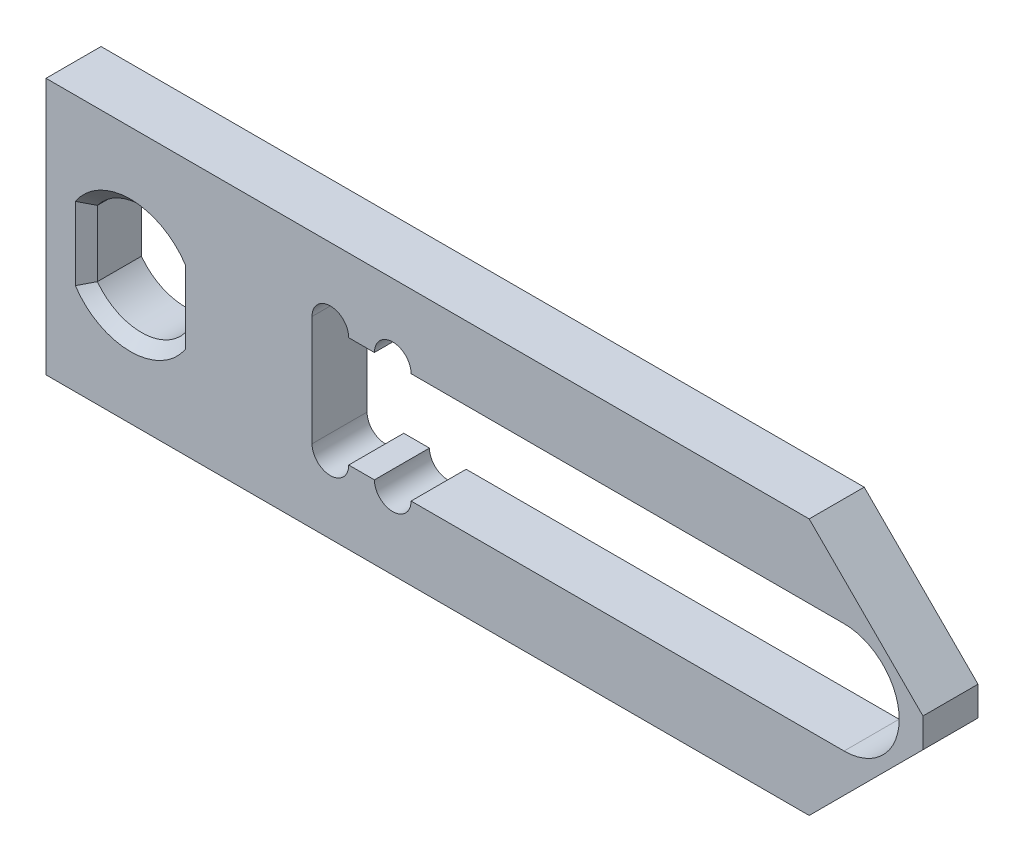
ISO-10303-21;
HEADER;
FILE_DESCRIPTION(('STEP AP214'),'2;1');
FILE_NAME('part.step','',(''),(''),'','','');
FILE_SCHEMA(('AUTOMOTIVE_DESIGN { 1 0 10303 214 1 1 1 1 }'));
ENDSEC;
DATA;
#1=APPLICATION_CONTEXT('core data for automotive mechanical design processes');
#2=APPLICATION_PROTOCOL_DEFINITION('international standard','automotive_design',2000,#1);
#3=PRODUCT_CONTEXT('',#1,'mechanical');
#4=PRODUCT('Part','Part','',(#3));
#5=PRODUCT_RELATED_PRODUCT_CATEGORY('part','',(#4));
#6=PRODUCT_DEFINITION_FORMATION('','',#4);
#7=PRODUCT_DEFINITION_CONTEXT('part definition',#1,'design');
#8=PRODUCT_DEFINITION('design','',#6,#7);
#9=PRODUCT_DEFINITION_SHAPE('','',#8);
#10=(LENGTH_UNIT() NAMED_UNIT(*) SI_UNIT(.MILLI.,.METRE.));
#11=(NAMED_UNIT(*) PLANE_ANGLE_UNIT() SI_UNIT($,.RADIAN.));
#12=(NAMED_UNIT(*) SI_UNIT($,.STERADIAN.) SOLID_ANGLE_UNIT());
#13=UNCERTAINTY_MEASURE_WITH_UNIT(LENGTH_MEASURE(1.E-05),#10,'distance_accuracy_value','');
#14=(GEOMETRIC_REPRESENTATION_CONTEXT(3) GLOBAL_UNCERTAINTY_ASSIGNED_CONTEXT((#13)) GLOBAL_UNIT_ASSIGNED_CONTEXT((#10,
#11,#12)) REPRESENTATION_CONTEXT('',''));
#15=CARTESIAN_POINT('',(0.,0.,0.));
#16=DIRECTION('',(0.,0.,1.));
#17=DIRECTION('',(1.,0.,0.));
#18=AXIS2_PLACEMENT_3D('',#15,#16,#17);
#19=CARTESIAN_POINT('',(-12.000000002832,8.99999999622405,7.5));
#20=DIRECTION('',(-1.,0.,0.));
#21=DIRECTION('',(0.,-1.,0.));
#22=AXIS2_PLACEMENT_3D('',#19,#20,#21);
#23=PLANE('',#22);
#24=DIRECTION('',(0.,0.,-1.));
#25=VECTOR('',#24,1.);
#26=CARTESIAN_POINT('',(-12.000000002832,8.99999999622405,7.5));
#27=LINE('',#26,#25);
#28=CARTESIAN_POINT('',(-12.000000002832,8.99999999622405,4.5));
#29=VERTEX_POINT('',#28);
#30=CARTESIAN_POINT('',(-12.000000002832,8.99999999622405,-7.5));
#31=VERTEX_POINT('',#30);
#32=EDGE_CURVE('E303',#29,#31,#27,.T.);
#33=ORIENTED_EDGE('',*,*,#32,.F.);
#34=DIRECTION('',(0.,-1.,0.));
#35=VECTOR('',#34,1.);
#36=CARTESIAN_POINT('',(-12.000000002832,-8.99999999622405,4.5));
#37=LINE('',#36,#35);
#38=CARTESIAN_POINT('',(-12.000000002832,-8.99999999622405,4.5));
#39=VERTEX_POINT('',#38);
#40=EDGE_CURVE('E11',#29,#39,#37,.T.);
#41=ORIENTED_EDGE('',*,*,#40,.T.);
#42=DIRECTION('',(0.,0.,-1.));
#43=VECTOR('',#42,1.);
#44=CARTESIAN_POINT('',(-12.000000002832,-8.99999999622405,7.5));
#45=LINE('',#44,#43);
#46=CARTESIAN_POINT('',(-12.000000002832,-8.99999999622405,-7.5));
#47=VERTEX_POINT('',#46);
#48=EDGE_CURVE('E306',#39,#47,#45,.T.);
#49=ORIENTED_EDGE('',*,*,#48,.T.);
#50=DIRECTION('',(0.,1.,0.));
#51=VECTOR('',#50,1.);
#52=CARTESIAN_POINT('',(-12.000000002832,8.99999999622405,-7.5));
#53=LINE('',#52,#51);
#54=EDGE_CURVE('E244',#47,#31,#53,.T.);
#55=ORIENTED_EDGE('',*,*,#54,.T.);
#56=EDGE_LOOP('',(#33,#41,#49,#55));
#57=FACE_BOUND('',#56,.T.);
#58=ADVANCED_FACE('F17',(#57),#23,.F.);
#59=CARTESIAN_POINT('',(0.,0.,7.5));
#60=DIRECTION('',(0.,0.,-1.));
#61=DIRECTION('',(-1.,0.,0.));
#62=AXIS2_PLACEMENT_3D('',#59,#60,#61);
#63=CYLINDRICAL_SURFACE('',#62,15.);
#64=DIRECTION('',(0.,0.,-1.));
#65=VECTOR('',#64,1.);
#66=CARTESIAN_POINT('',(12.000000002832,8.99999999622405,7.5));
#67=LINE('',#66,#65);
#68=CARTESIAN_POINT('',(12.000000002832,8.99999999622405,4.5));
#69=VERTEX_POINT('',#68);
#70=CARTESIAN_POINT('',(12.000000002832,8.99999999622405,-7.5));
#71=VERTEX_POINT('',#70);
#72=EDGE_CURVE('E301',#69,#71,#67,.T.);
#73=ORIENTED_EDGE('',*,*,#72,.F.);
#74=CARTESIAN_POINT('',(0.,0.,4.5));
#75=DIRECTION('',(0.,0.,1.));
#76=DIRECTION('',(1.,0.,0.));
#77=AXIS2_PLACEMENT_3D('',#74,#75,#76);
#78=CIRCLE('',#77,15.);
#79=EDGE_CURVE('E25',#69,#29,#78,.T.);
#80=ORIENTED_EDGE('',*,*,#79,.T.);
#81=ORIENTED_EDGE('',*,*,#32,.T.);
#82=CARTESIAN_POINT('',(0.,0.,-7.5));
#83=DIRECTION('',(0.,0.,-1.));
#84=DIRECTION('',(1.,0.,0.));
#85=AXIS2_PLACEMENT_3D('',#82,#83,#84);
#86=CIRCLE('',#85,15.);
#87=EDGE_CURVE('E256',#31,#71,#86,.T.);
#88=ORIENTED_EDGE('',*,*,#87,.T.);
#89=EDGE_LOOP('',(#73,#80,#81,#88));
#90=FACE_BOUND('',#89,.T.);
#91=ADVANCED_FACE('F411',(#90),#63,.F.);
#92=CARTESIAN_POINT('',(12.000000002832,8.99999999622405,7.5));
#93=DIRECTION('',(1.,0.,0.));
#94=DIRECTION('',(0.,1.,0.));
#95=AXIS2_PLACEMENT_3D('',#92,#93,#94);
#96=PLANE('',#95);
#97=DIRECTION('',(0.,0.,-1.));
#98=VECTOR('',#97,1.);
#99=CARTESIAN_POINT('',(12.000000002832,-8.99999999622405,7.5));
#100=LINE('',#99,#98);
#101=CARTESIAN_POINT('',(12.000000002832,-8.99999999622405,4.5));
#102=VERTEX_POINT('',#101);
#103=CARTESIAN_POINT('',(12.000000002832,-8.99999999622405,-7.5));
#104=VERTEX_POINT('',#103);
#105=EDGE_CURVE('E304',#102,#104,#100,.T.);
#106=ORIENTED_EDGE('',*,*,#105,.F.);
#107=DIRECTION('',(0.,1.,0.));
#108=VECTOR('',#107,1.);
#109=CARTESIAN_POINT('',(12.000000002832,8.99999999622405,4.5));
#110=LINE('',#109,#108);
#111=EDGE_CURVE('E39',#102,#69,#110,.T.);
#112=ORIENTED_EDGE('',*,*,#111,.T.);
#113=ORIENTED_EDGE('',*,*,#72,.T.);
#114=DIRECTION('',(0.,-1.,0.));
#115=VECTOR('',#114,1.);
#116=CARTESIAN_POINT('',(12.000000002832,8.99999999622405,-7.5));
#117=LINE('',#116,#115);
#118=EDGE_CURVE('E252',#71,#104,#117,.T.);
#119=ORIENTED_EDGE('',*,*,#118,.T.);
#120=EDGE_LOOP('',(#106,#112,#113,#119));
#121=FACE_BOUND('',#120,.T.);
#122=ADVANCED_FACE('F357',(#121),#96,.F.);
#123=CARTESIAN_POINT('',(71.5,-15.025,7.5));
#124=DIRECTION('',(0.,0.,-1.));
#125=DIRECTION('',(-1.,0.,0.));
#126=AXIS2_PLACEMENT_3D('',#123,#124,#125);
#127=CYLINDRICAL_SURFACE('',#126,5.);
#128=CARTESIAN_POINT('',(71.5,-15.025,-7.5));
#129=DIRECTION('',(0.,0.,1.));
#130=DIRECTION('',(-1.,0.,0.));
#131=AXIS2_PLACEMENT_3D('',#128,#129,#130);
#132=CIRCLE('',#131,5.);
#133=CARTESIAN_POINT('',(66.5,-15.025,-7.5));
#134=VERTEX_POINT('',#133);
#135=CARTESIAN_POINT('',(76.5,-15.025,-7.5));
#136=VERTEX_POINT('',#135);
#137=EDGE_CURVE('E240',#134,#136,#132,.T.);
#138=ORIENTED_EDGE('',*,*,#137,.F.);
#139=DIRECTION('',(0.,0.,-1.));
#140=VECTOR('',#139,1.);
#141=CARTESIAN_POINT('',(66.5,-15.025,7.5));
#142=LINE('',#141,#140);
#143=CARTESIAN_POINT('',(66.5,-15.025,7.5));
#144=VERTEX_POINT('',#143);
#145=EDGE_CURVE('E310',#144,#134,#142,.T.);
#146=ORIENTED_EDGE('',*,*,#145,.F.);
#147=CARTESIAN_POINT('',(71.5,-15.025,7.5));
#148=DIRECTION('',(0.,0.,1.));
#149=DIRECTION('',(-1.,0.,0.));
#150=AXIS2_PLACEMENT_3D('',#147,#148,#149);
#151=CIRCLE('',#150,5.);
#152=CARTESIAN_POINT('',(76.5,-15.025,7.5));
#153=VERTEX_POINT('',#152);
#154=EDGE_CURVE('E298',#144,#153,#151,.T.);
#155=ORIENTED_EDGE('',*,*,#154,.T.);
#156=DIRECTION('',(0.,0.,-1.));
#157=VECTOR('',#156,1.);
#158=CARTESIAN_POINT('',(76.5,-15.025,7.5));
#159=LINE('',#158,#157);
#160=EDGE_CURVE('E186',#153,#136,#159,.T.);
#161=ORIENTED_EDGE('',*,*,#160,.T.);
#162=EDGE_LOOP('',(#138,#146,#155,#161));
#163=FACE_BOUND('',#162,.T.);
#164=ADVANCED_FACE('F416',(#163),#127,.F.);
#165=CARTESIAN_POINT('',(59.5,-15.025,7.5));
#166=DIRECTION('',(0.,1.,0.));
#167=DIRECTION('',(-1.,0.,0.));
#168=AXIS2_PLACEMENT_3D('',#165,#166,#167);
#169=PLANE('',#168);
#170=DIRECTION('',(1.,0.,0.));
#171=VECTOR('',#170,1.);
#172=CARTESIAN_POINT('',(59.5,-15.025,-7.5));
#173=LINE('',#172,#171);
#174=CARTESIAN_POINT('',(59.5,-15.025,-7.5));
#175=VERTEX_POINT('',#174);
#176=EDGE_CURVE('E204',#175,#134,#173,.T.);
#177=ORIENTED_EDGE('',*,*,#176,.F.);
#178=DIRECTION('',(0.,0.,-1.));
#179=VECTOR('',#178,1.);
#180=CARTESIAN_POINT('',(59.5,-15.025,7.5));
#181=LINE('',#180,#179);
#182=CARTESIAN_POINT('',(59.5,-15.025,7.5));
#183=VERTEX_POINT('',#182);
#184=EDGE_CURVE('E326',#183,#175,#181,.T.);
#185=ORIENTED_EDGE('',*,*,#184,.F.);
#186=DIRECTION('',(1.,0.,0.));
#187=VECTOR('',#186,1.);
#188=CARTESIAN_POINT('',(59.5,-15.025,7.5));
#189=LINE('',#188,#187);
#190=EDGE_CURVE('E270',#183,#144,#189,.T.);
#191=ORIENTED_EDGE('',*,*,#190,.T.);
#192=ORIENTED_EDGE('',*,*,#145,.T.);
#193=EDGE_LOOP('',(#177,#185,#191,#192));
#194=FACE_BOUND('',#193,.T.);
#195=ADVANCED_FACE('F424',(#194),#169,.T.);
#196=CARTESIAN_POINT('',(54.5,-15.025,7.5));
#197=DIRECTION('',(0.,0.,-1.));
#198=DIRECTION('',(-1.,0.,0.));
#199=AXIS2_PLACEMENT_3D('',#196,#197,#198);
#200=CYLINDRICAL_SURFACE('',#199,5.);
#201=CARTESIAN_POINT('',(54.5,-15.025,-7.5));
#202=DIRECTION('',(0.,0.,1.));
#203=DIRECTION('',(-1.,0.,0.));
#204=AXIS2_PLACEMENT_3D('',#201,#202,#203);
#205=CIRCLE('',#204,5.);
#206=CARTESIAN_POINT('',(49.5,-15.025,-7.5));
#207=VERTEX_POINT('',#206);
#208=EDGE_CURVE('E208',#207,#175,#205,.T.);
#209=ORIENTED_EDGE('',*,*,#208,.F.);
#210=DIRECTION('',(0.,0.,-1.));
#211=VECTOR('',#210,1.);
#212=CARTESIAN_POINT('',(49.5,-15.025,7.5));
#213=LINE('',#212,#211);
#214=CARTESIAN_POINT('',(49.5,-15.025,7.5));
#215=VERTEX_POINT('',#214);
#216=EDGE_CURVE('E324',#215,#207,#213,.T.);
#217=ORIENTED_EDGE('',*,*,#216,.F.);
#218=CARTESIAN_POINT('',(54.5,-15.025,7.5));
#219=DIRECTION('',(0.,0.,1.));
#220=DIRECTION('',(-1.,0.,0.));
#221=AXIS2_PLACEMENT_3D('',#218,#219,#220);
#222=CIRCLE('',#221,5.);
#223=EDGE_CURVE('E274',#215,#183,#222,.T.);
#224=ORIENTED_EDGE('',*,*,#223,.T.);
#225=ORIENTED_EDGE('',*,*,#184,.T.);
#226=EDGE_LOOP('',(#209,#217,#224,#225));
#227=FACE_BOUND('',#226,.T.);
#228=ADVANCED_FACE('F454',(#227),#200,.F.);
#229=CARTESIAN_POINT('',(49.5,15.025,7.5));
#230=DIRECTION('',(1.,0.,0.));
#231=DIRECTION('',(0.,0.,-1.));
#232=AXIS2_PLACEMENT_3D('',#229,#230,#231);
#233=PLANE('',#232);
#234=DIRECTION('',(0.,-1.,0.));
#235=VECTOR('',#234,1.);
#236=CARTESIAN_POINT('',(49.5,15.025,-7.5));
#237=LINE('',#236,#235);
#238=CARTESIAN_POINT('',(49.5,15.025,-7.5));
#239=VERTEX_POINT('',#238);
#240=EDGE_CURVE('E212',#239,#207,#237,.T.);
#241=ORIENTED_EDGE('',*,*,#240,.F.);
#242=DIRECTION('',(0.,0.,-1.));
#243=VECTOR('',#242,1.);
#244=CARTESIAN_POINT('',(49.5,15.025,7.5));
#245=LINE('',#244,#243);
#246=CARTESIAN_POINT('',(49.5,15.025,7.5));
#247=VERTEX_POINT('',#246);
#248=EDGE_CURVE('E322',#247,#239,#245,.T.);
#249=ORIENTED_EDGE('',*,*,#248,.F.);
#250=DIRECTION('',(0.,-1.,0.));
#251=VECTOR('',#250,1.);
#252=CARTESIAN_POINT('',(49.5,15.025,7.5));
#253=LINE('',#252,#251);
#254=EDGE_CURVE('E277',#247,#215,#253,.T.);
#255=ORIENTED_EDGE('',*,*,#254,.T.);
#256=ORIENTED_EDGE('',*,*,#216,.T.);
#257=EDGE_LOOP('',(#241,#249,#255,#256));
#258=FACE_BOUND('',#257,.T.);
#259=ADVANCED_FACE('F450',(#258),#233,.T.);
#260=CARTESIAN_POINT('',(54.5,15.025,7.5));
#261=DIRECTION('',(0.,0.,-1.));
#262=DIRECTION('',(-1.,0.,0.));
#263=AXIS2_PLACEMENT_3D('',#260,#261,#262);
#264=CYLINDRICAL_SURFACE('',#263,5.);
#265=CARTESIAN_POINT('',(54.5,15.025,-7.5));
#266=DIRECTION('',(0.,0.,1.));
#267=DIRECTION('',(1.,0.,0.));
#268=AXIS2_PLACEMENT_3D('',#265,#266,#267);
#269=CIRCLE('',#268,5.);
#270=CARTESIAN_POINT('',(59.5,15.025,-7.5));
#271=VERTEX_POINT('',#270);
#272=EDGE_CURVE('E216',#271,#239,#269,.T.);
#273=ORIENTED_EDGE('',*,*,#272,.F.);
#274=DIRECTION('',(0.,0.,-1.));
#275=VECTOR('',#274,1.);
#276=CARTESIAN_POINT('',(59.5,15.025,7.5));
#277=LINE('',#276,#275);
#278=CARTESIAN_POINT('',(59.5,15.025,7.5));
#279=VERTEX_POINT('',#278);
#280=EDGE_CURVE('E320',#279,#271,#277,.T.);
#281=ORIENTED_EDGE('',*,*,#280,.F.);
#282=CARTESIAN_POINT('',(54.5,15.025,7.5));
#283=DIRECTION('',(0.,0.,1.));
#284=DIRECTION('',(1.,0.,0.));
#285=AXIS2_PLACEMENT_3D('',#282,#283,#284);
#286=CIRCLE('',#285,5.);
#287=EDGE_CURVE('E280',#279,#247,#286,.T.);
#288=ORIENTED_EDGE('',*,*,#287,.T.);
#289=ORIENTED_EDGE('',*,*,#248,.T.);
#290=EDGE_LOOP('',(#273,#281,#288,#289));
#291=FACE_BOUND('',#290,.T.);
#292=ADVANCED_FACE('F446',(#291),#264,.F.);
#293=CARTESIAN_POINT('',(66.5,15.025,7.5));
#294=DIRECTION('',(0.,-1.,0.));
#295=DIRECTION('',(1.,0.,0.));
#296=AXIS2_PLACEMENT_3D('',#293,#294,#295);
#297=PLANE('',#296);
#298=DIRECTION('',(-1.,0.,0.));
#299=VECTOR('',#298,1.);
#300=CARTESIAN_POINT('',(66.5,15.025,-7.5));
#301=LINE('',#300,#299);
#302=CARTESIAN_POINT('',(66.5,15.025,-7.5));
#303=VERTEX_POINT('',#302);
#304=EDGE_CURVE('E220',#303,#271,#301,.T.);
#305=ORIENTED_EDGE('',*,*,#304,.F.);
#306=DIRECTION('',(0.,0.,-1.));
#307=VECTOR('',#306,1.);
#308=CARTESIAN_POINT('',(66.5,15.025,7.5));
#309=LINE('',#308,#307);
#310=CARTESIAN_POINT('',(66.5,15.025,7.5));
#311=VERTEX_POINT('',#310);
#312=EDGE_CURVE('E318',#311,#303,#309,.T.);
#313=ORIENTED_EDGE('',*,*,#312,.F.);
#314=DIRECTION('',(-1.,0.,0.));
#315=VECTOR('',#314,1.);
#316=CARTESIAN_POINT('',(66.5,15.025,7.5));
#317=LINE('',#316,#315);
#318=EDGE_CURVE('E283',#311,#279,#317,.T.);
#319=ORIENTED_EDGE('',*,*,#318,.T.);
#320=ORIENTED_EDGE('',*,*,#280,.T.);
#321=EDGE_LOOP('',(#305,#313,#319,#320));
#322=FACE_BOUND('',#321,.T.);
#323=ADVANCED_FACE('F442',(#322),#297,.T.);
#324=CARTESIAN_POINT('',(71.5,15.025,7.5));
#325=DIRECTION('',(0.,0.,-1.));
#326=DIRECTION('',(-1.,0.,0.));
#327=AXIS2_PLACEMENT_3D('',#324,#325,#326);
#328=CYLINDRICAL_SURFACE('',#327,5.);
#329=CARTESIAN_POINT('',(71.5,15.025,-7.5));
#330=DIRECTION('',(0.,0.,1.));
#331=DIRECTION('',(1.,0.,0.));
#332=AXIS2_PLACEMENT_3D('',#329,#330,#331);
#333=CIRCLE('',#332,5.);
#334=CARTESIAN_POINT('',(76.5,15.025,-7.5));
#335=VERTEX_POINT('',#334);
#336=EDGE_CURVE('E224',#335,#303,#333,.T.);
#337=ORIENTED_EDGE('',*,*,#336,.F.);
#338=DIRECTION('',(0.,0.,-1.));
#339=VECTOR('',#338,1.);
#340=CARTESIAN_POINT('',(76.5,15.025,7.5));
#341=LINE('',#340,#339);
#342=CARTESIAN_POINT('',(76.5,15.025,7.5));
#343=VERTEX_POINT('',#342);
#344=EDGE_CURVE('E316',#343,#335,#341,.T.);
#345=ORIENTED_EDGE('',*,*,#344,.F.);
#346=CARTESIAN_POINT('',(71.5,15.025,7.5));
#347=DIRECTION('',(0.,0.,1.));
#348=DIRECTION('',(1.,0.,0.));
#349=AXIS2_PLACEMENT_3D('',#346,#347,#348);
#350=CIRCLE('',#349,5.);
#351=EDGE_CURVE('E286',#343,#311,#350,.T.);
#352=ORIENTED_EDGE('',*,*,#351,.T.);
#353=ORIENTED_EDGE('',*,*,#312,.T.);
#354=EDGE_LOOP('',(#337,#345,#352,#353));
#355=FACE_BOUND('',#354,.T.);
#356=ADVANCED_FACE('F438',(#355),#328,.F.);
#357=CARTESIAN_POINT('',(194.5,15.025,7.5));
#358=DIRECTION('',(0.,-1.,0.));
#359=DIRECTION('',(1.,0.,0.));
#360=AXIS2_PLACEMENT_3D('',#357,#358,#359);
#361=PLANE('',#360);
#362=DIRECTION('',(-1.,0.,0.));
#363=VECTOR('',#362,1.);
#364=CARTESIAN_POINT('',(194.5,15.025,-7.5));
#365=LINE('',#364,#363);
#366=CARTESIAN_POINT('',(194.5,15.025,-7.5));
#367=VERTEX_POINT('',#366);
#368=EDGE_CURVE('E228',#367,#335,#365,.T.);
#369=ORIENTED_EDGE('',*,*,#368,.F.);
#370=DIRECTION('',(0.,0.,-1.));
#371=VECTOR('',#370,1.);
#372=CARTESIAN_POINT('',(194.5,15.025,7.5));
#373=LINE('',#372,#371);
#374=CARTESIAN_POINT('',(194.5,15.025,7.5));
#375=VERTEX_POINT('',#374);
#376=EDGE_CURVE('E314',#375,#367,#373,.T.);
#377=ORIENTED_EDGE('',*,*,#376,.F.);
#378=DIRECTION('',(-1.,0.,0.));
#379=VECTOR('',#378,1.);
#380=CARTESIAN_POINT('',(194.5,15.025,7.5));
#381=LINE('',#380,#379);
#382=EDGE_CURVE('E289',#375,#343,#381,.T.);
#383=ORIENTED_EDGE('',*,*,#382,.T.);
#384=ORIENTED_EDGE('',*,*,#344,.T.);
#385=EDGE_LOOP('',(#369,#377,#383,#384));
#386=FACE_BOUND('',#385,.T.);
#387=ADVANCED_FACE('F434',(#386),#361,.T.);
#388=CARTESIAN_POINT('',(194.5,0.,7.5));
#389=DIRECTION('',(0.,0.,-1.));
#390=DIRECTION('',(-1.,0.,0.));
#391=AXIS2_PLACEMENT_3D('',#388,#389,#390);
#392=CYLINDRICAL_SURFACE('',#391,15.025);
#393=CARTESIAN_POINT('',(194.5,0.,-7.5));
#394=DIRECTION('',(0.,0.,1.));
#395=DIRECTION('',(-1.,0.,0.));
#396=AXIS2_PLACEMENT_3D('',#393,#394,#395);
#397=CIRCLE('',#396,15.025);
#398=CARTESIAN_POINT('',(194.5,-15.025,-7.5));
#399=VERTEX_POINT('',#398);
#400=EDGE_CURVE('E232',#399,#367,#397,.T.);
#401=ORIENTED_EDGE('',*,*,#400,.F.);
#402=DIRECTION('',(0.,0.,-1.));
#403=VECTOR('',#402,1.);
#404=CARTESIAN_POINT('',(194.5,-15.025,7.5));
#405=LINE('',#404,#403);
#406=CARTESIAN_POINT('',(194.5,-15.025,7.5));
#407=VERTEX_POINT('',#406);
#408=EDGE_CURVE('E312',#407,#399,#405,.T.);
#409=ORIENTED_EDGE('',*,*,#408,.F.);
#410=CARTESIAN_POINT('',(194.5,0.,7.5));
#411=DIRECTION('',(0.,0.,1.));
#412=DIRECTION('',(-1.,0.,0.));
#413=AXIS2_PLACEMENT_3D('',#410,#411,#412);
#414=CIRCLE('',#413,15.025);
#415=EDGE_CURVE('E292',#407,#375,#414,.T.);
#416=ORIENTED_EDGE('',*,*,#415,.T.);
#417=ORIENTED_EDGE('',*,*,#376,.T.);
#418=EDGE_LOOP('',(#401,#409,#416,#417));
#419=FACE_BOUND('',#418,.T.);
#420=ADVANCED_FACE('F431',(#419),#392,.F.);
#421=CARTESIAN_POINT('',(-23.,35.,7.5));
#422=DIRECTION('',(1.,0.,0.));
#423=DIRECTION('',(0.,0.,-1.));
#424=AXIS2_PLACEMENT_3D('',#421,#422,#423);
#425=PLANE('',#424);
#426=DIRECTION('',(0.,-1.,0.));
#427=VECTOR('',#426,1.);
#428=CARTESIAN_POINT('',(-23.,35.,-7.5));
#429=LINE('',#428,#427);
#430=CARTESIAN_POINT('',(-23.,35.,-7.5));
#431=VERTEX_POINT('',#430);
#432=CARTESIAN_POINT('',(-23.,-35.,-7.5));
#433=VERTEX_POINT('',#432);
#434=EDGE_CURVE('E171',#431,#433,#429,.T.);
#435=ORIENTED_EDGE('',*,*,#434,.T.);
#436=DIRECTION('',(0.,0.,-1.));
#437=VECTOR('',#436,1.);
#438=CARTESIAN_POINT('',(-23.,-35.,7.5));
#439=LINE('',#438,#437);
#440=CARTESIAN_POINT('',(-23.,-35.,7.5));
#441=VERTEX_POINT('',#440);
#442=EDGE_CURVE('E180',#441,#433,#439,.T.);
#443=ORIENTED_EDGE('',*,*,#442,.F.);
#444=DIRECTION('',(0.,-1.,0.));
#445=VECTOR('',#444,1.);
#446=CARTESIAN_POINT('',(-23.,35.,7.5));
#447=LINE('',#446,#445);
#448=CARTESIAN_POINT('',(-23.,35.,7.5));
#449=VERTEX_POINT('',#448);
#450=EDGE_CURVE('E260',#449,#441,#447,.T.);
#451=ORIENTED_EDGE('',*,*,#450,.F.);
#452=DIRECTION('',(0.,0.,-1.));
#453=VECTOR('',#452,1.);
#454=CARTESIAN_POINT('',(-23.,35.,7.5));
#455=LINE('',#454,#453);
#456=EDGE_CURVE('E191',#449,#431,#455,.T.);
#457=ORIENTED_EDGE('',*,*,#456,.T.);
#458=EDGE_LOOP('',(#435,#443,#451,#457));
#459=FACE_BOUND('',#458,.T.);
#460=ADVANCED_FACE('F19',(#459),#425,.F.);
#461=CARTESIAN_POINT('',(-23.,-35.,7.5));
#462=DIRECTION('',(0.,1.,0.));
#463=DIRECTION('',(0.,0.,1.));
#464=AXIS2_PLACEMENT_3D('',#461,#462,#463);
#465=PLANE('',#464);
#466=DIRECTION('',(1.,0.,0.));
#467=VECTOR('',#466,1.);
#468=CARTESIAN_POINT('',(-23.,-35.,-7.5));
#469=LINE('',#468,#467);
#470=CARTESIAN_POINT('',(184.991199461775,-35.,-7.5));
#471=VERTEX_POINT('',#470);
#472=EDGE_CURVE('E165',#433,#471,#469,.T.);
#473=ORIENTED_EDGE('',*,*,#472,.T.);
#474=DIRECTION('',(0.,0.,-1.));
#475=VECTOR('',#474,1.);
#476=CARTESIAN_POINT('',(184.991199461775,-35.,7.5));
#477=LINE('',#476,#475);
#478=CARTESIAN_POINT('',(184.991199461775,-35.,7.5));
#479=VERTEX_POINT('',#478);
#480=EDGE_CURVE('E187',#479,#471,#477,.T.);
#481=ORIENTED_EDGE('',*,*,#480,.F.);
#482=DIRECTION('',(1.,0.,0.));
#483=VECTOR('',#482,1.);
#484=CARTESIAN_POINT('',(-23.,-35.,7.5));
#485=LINE('',#484,#483);
#486=EDGE_CURVE('E182',#441,#479,#485,.T.);
#487=ORIENTED_EDGE('',*,*,#486,.F.);
#488=ORIENTED_EDGE('',*,*,#442,.T.);
#489=EDGE_LOOP('',(#473,#481,#487,#488));
#490=FACE_BOUND('',#489,.T.);
#491=ADVANCED_FACE('F181',(#490),#465,.F.);
#492=CARTESIAN_POINT('',(216.,-3.99119946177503,7.5));
#493=DIRECTION('',(-0.707106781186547,0.707106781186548,0.));
#494=DIRECTION('',(-0.707106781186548,-0.707106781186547,0.));
#495=AXIS2_PLACEMENT_3D('',#492,#493,#494);
#496=PLANE('',#495);
#497=DIRECTION('',(0.707106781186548,0.707106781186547,0.));
#498=VECTOR('',#497,1.);
#499=CARTESIAN_POINT('',(216.,-3.99119946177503,-7.5));
#500=LINE('',#499,#498);
#501=CARTESIAN_POINT('',(216.,-3.99119946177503,-7.5));
#502=VERTEX_POINT('',#501);
#503=EDGE_CURVE('E173',#471,#502,#500,.T.);
#504=ORIENTED_EDGE('',*,*,#503,.T.);
#505=DIRECTION('',(0.,0.,-1.));
#506=VECTOR('',#505,1.);
#507=CARTESIAN_POINT('',(216.,-3.99119946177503,7.5));
#508=LINE('',#507,#506);
#509=CARTESIAN_POINT('',(216.,-3.99119946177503,7.5));
#510=VERTEX_POINT('',#509);
#511=EDGE_CURVE('E336',#510,#502,#508,.T.);
#512=ORIENTED_EDGE('',*,*,#511,.F.);
#513=DIRECTION('',(0.707106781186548,0.707106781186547,0.));
#514=VECTOR('',#513,1.);
#515=CARTESIAN_POINT('',(216.,-3.99119946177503,7.5));
#516=LINE('',#515,#514);
#517=EDGE_CURVE('E262',#479,#510,#516,.T.);
#518=ORIENTED_EDGE('',*,*,#517,.F.);
#519=ORIENTED_EDGE('',*,*,#480,.T.);
#520=EDGE_LOOP('',(#504,#512,#518,#519));
#521=FACE_BOUND('',#520,.T.);
#522=ADVANCED_FACE('F471',(#521),#496,.F.);
#523=CARTESIAN_POINT('',(216.,-3.99119946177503,7.5));
#524=DIRECTION('',(-1.,0.,0.));
#525=DIRECTION('',(0.,-1.,0.));
#526=AXIS2_PLACEMENT_3D('',#523,#524,#525);
#527=PLANE('',#526);
#528=DIRECTION('',(0.,1.,0.));
#529=VECTOR('',#528,1.);
#530=CARTESIAN_POINT('',(216.,-3.99119946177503,-7.5));
#531=LINE('',#530,#529);
#532=CARTESIAN_POINT('',(216.000000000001,3.9911994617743,-7.5));
#533=VERTEX_POINT('',#532);
#534=EDGE_CURVE('E885',#502,#533,#531,.T.);
#535=ORIENTED_EDGE('',*,*,#534,.T.);
#536=DIRECTION('',(0.,0.,-1.));
#537=VECTOR('',#536,1.);
#538=CARTESIAN_POINT('',(216.000000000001,3.9911994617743,7.5));
#539=LINE('',#538,#537);
#540=CARTESIAN_POINT('',(216.000000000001,3.9911994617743,7.5));
#541=VERTEX_POINT('',#540);
#542=EDGE_CURVE('E333',#541,#533,#539,.T.);
#543=ORIENTED_EDGE('',*,*,#542,.F.);
#544=DIRECTION('',(0.,1.,0.));
#545=VECTOR('',#544,1.);
#546=CARTESIAN_POINT('',(216.,-3.99119946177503,7.5));
#547=LINE('',#546,#545);
#548=EDGE_CURVE('E264',#510,#541,#547,.T.);
#549=ORIENTED_EDGE('',*,*,#548,.F.);
#550=ORIENTED_EDGE('',*,*,#511,.T.);
#551=EDGE_LOOP('',(#535,#543,#549,#550));
#552=FACE_BOUND('',#551,.T.);
#553=ADVANCED_FACE('F467',(#552),#527,.F.);
#554=CARTESIAN_POINT('',(184.991199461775,35.0000000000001,7.5));
#555=DIRECTION('',(-0.707106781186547,-0.707106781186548,0.));
#556=DIRECTION('',(0.707106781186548,-0.707106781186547,0.));
#557=AXIS2_PLACEMENT_3D('',#554,#555,#556);
#558=PLANE('',#557);
#559=DIRECTION('',(-0.707106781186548,0.707106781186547,0.));
#560=VECTOR('',#559,1.);
#561=CARTESIAN_POINT('',(184.991199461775,35.0000000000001,-7.5));
#562=LINE('',#561,#560);
#563=CARTESIAN_POINT('',(184.991199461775,35.0000000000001,-7.5));
#564=VERTEX_POINT('',#563);
#565=EDGE_CURVE('E882',#533,#564,#562,.T.);
#566=ORIENTED_EDGE('',*,*,#565,.T.);
#567=DIRECTION('',(0.,0.,-1.));
#568=VECTOR('',#567,1.);
#569=CARTESIAN_POINT('',(184.991199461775,35.0000000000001,7.5));
#570=LINE('',#569,#568);
#571=CARTESIAN_POINT('',(184.991199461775,35.0000000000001,7.5));
#572=VERTEX_POINT('',#571);
#573=EDGE_CURVE('E330',#572,#564,#570,.T.);
#574=ORIENTED_EDGE('',*,*,#573,.F.);
#575=DIRECTION('',(-0.707106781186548,0.707106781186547,0.));
#576=VECTOR('',#575,1.);
#577=CARTESIAN_POINT('',(184.991199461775,35.0000000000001,7.5));
#578=LINE('',#577,#576);
#579=EDGE_CURVE('E266',#541,#572,#578,.T.);
#580=ORIENTED_EDGE('',*,*,#579,.F.);
#581=ORIENTED_EDGE('',*,*,#542,.T.);
#582=EDGE_LOOP('',(#566,#574,#580,#581));
#583=FACE_BOUND('',#582,.T.);
#584=ADVANCED_FACE('F429',(#583),#558,.F.);
#585=CARTESIAN_POINT('',(76.5,-15.025,7.5));
#586=DIRECTION('',(0.,1.,0.));
#587=DIRECTION('',(-1.,0.,0.));
#588=AXIS2_PLACEMENT_3D('',#585,#586,#587);
#589=PLANE('',#588);
#590=DIRECTION('',(1.,0.,0.));
#591=VECTOR('',#590,1.);
#592=CARTESIAN_POINT('',(76.5,-15.025,-7.5));
#593=LINE('',#592,#591);
#594=EDGE_CURVE('E236',#136,#399,#593,.T.);
#595=ORIENTED_EDGE('',*,*,#594,.F.);
#596=ORIENTED_EDGE('',*,*,#160,.F.);
#597=DIRECTION('',(1.,0.,0.));
#598=VECTOR('',#597,1.);
#599=CARTESIAN_POINT('',(76.5,-15.025,7.5));
#600=LINE('',#599,#598);
#601=EDGE_CURVE('E295',#153,#407,#600,.T.);
#602=ORIENTED_EDGE('',*,*,#601,.T.);
#603=ORIENTED_EDGE('',*,*,#408,.T.);
#604=EDGE_LOOP('',(#595,#596,#602,#603));
#605=FACE_BOUND('',#604,.T.);
#606=ADVANCED_FACE('F426',(#605),#589,.T.);
#607=CARTESIAN_POINT('',(184.991199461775,35.0000000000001,7.5));
#608=DIRECTION('',(0.,-1.,0.));
#609=DIRECTION('',(1.,0.,0.));
#610=AXIS2_PLACEMENT_3D('',#607,#608,#609);
#611=PLANE('',#610);
#612=DIRECTION('',(-1.,0.,0.));
#613=VECTOR('',#612,1.);
#614=CARTESIAN_POINT('',(184.991199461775,35.0000000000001,-7.5));
#615=LINE('',#614,#613);
#616=EDGE_CURVE('E202',#564,#431,#615,.T.);
#617=ORIENTED_EDGE('',*,*,#616,.T.);
#618=ORIENTED_EDGE('',*,*,#456,.F.);
#619=DIRECTION('',(-1.,0.,0.));
#620=VECTOR('',#619,1.);
#621=CARTESIAN_POINT('',(184.991199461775,35.0000000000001,7.5));
#622=LINE('',#621,#620);
#623=EDGE_CURVE('E268',#572,#449,#622,.T.);
#624=ORIENTED_EDGE('',*,*,#623,.F.);
#625=ORIENTED_EDGE('',*,*,#573,.T.);
#626=EDGE_LOOP('',(#617,#618,#624,#625));
#627=FACE_BOUND('',#626,.T.);
#628=ADVANCED_FACE('F419',(#627),#611,.F.);
#629=CARTESIAN_POINT('',(0.,0.,7.5));
#630=DIRECTION('',(0.,0.,-1.));
#631=DIRECTION('',(-1.,0.,0.));
#632=AXIS2_PLACEMENT_3D('',#629,#630,#631);
#633=CYLINDRICAL_SURFACE('',#632,15.);
#634=ORIENTED_EDGE('',*,*,#48,.F.);
#635=CARTESIAN_POINT('',(0.,0.,4.5));
#636=DIRECTION('',(0.,0.,1.));
#637=DIRECTION('',(1.,0.,0.));
#638=AXIS2_PLACEMENT_3D('',#635,#636,#637);
#639=CIRCLE('',#638,15.);
#640=EDGE_CURVE('E348',#39,#102,#639,.T.);
#641=ORIENTED_EDGE('',*,*,#640,.T.);
#642=ORIENTED_EDGE('',*,*,#105,.T.);
#643=CARTESIAN_POINT('',(0.,0.,-7.5));
#644=DIRECTION('',(0.,0.,-1.));
#645=DIRECTION('',(1.,0.,0.));
#646=AXIS2_PLACEMENT_3D('',#643,#644,#645);
#647=CIRCLE('',#646,15.);
#648=EDGE_CURVE('E248',#104,#47,#647,.T.);
#649=ORIENTED_EDGE('',*,*,#648,.T.);
#650=EDGE_LOOP('',(#634,#641,#642,#649));
#651=FACE_BOUND('',#650,.T.);
#652=ADVANCED_FACE('F354',(#651),#633,.F.);
#653=CARTESIAN_POINT('',(-23.,-35.,7.5));
#654=DIRECTION('',(0.,0.,1.));
#655=DIRECTION('',(1.,0.,0.));
#656=AXIS2_PLACEMENT_3D('',#653,#654,#655);
#657=PLANE('',#656);
#658=DIRECTION('',(0.,-1.,0.));
#659=VECTOR('',#658,1.);
#660=CARTESIAN_POINT('',(15.000000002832,-8.99999999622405,7.5));
#661=LINE('',#660,#659);
#662=CARTESIAN_POINT('',(15.000000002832,9.94987436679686,7.5));
#663=VERTEX_POINT('',#662);
#664=CARTESIAN_POINT('',(15.000000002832,-9.94987436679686,7.5));
#665=VERTEX_POINT('',#664);
#666=EDGE_CURVE('E343',#663,#665,#661,.T.);
#667=ORIENTED_EDGE('',*,*,#666,.T.);
#668=CARTESIAN_POINT('',(0.,0.,7.5));
#669=DIRECTION('',(0.,0.,1.));
#670=DIRECTION('',(1.,0.,0.));
#671=AXIS2_PLACEMENT_3D('',#668,#669,#670);
#672=CIRCLE('',#671,18.);
#673=CARTESIAN_POINT('',(-15.000000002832,-9.94987436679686,7.5));
#674=VERTEX_POINT('',#673);
#675=EDGE_CURVE('E345',#665,#674,#672,.F.);
#676=ORIENTED_EDGE('',*,*,#675,.T.);
#677=DIRECTION('',(0.,1.,0.));
#678=VECTOR('',#677,1.);
#679=CARTESIAN_POINT('',(-15.000000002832,8.99999999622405,7.5));
#680=LINE('',#679,#678);
#681=CARTESIAN_POINT('',(-15.000000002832,9.94987436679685,7.5));
#682=VERTEX_POINT('',#681);
#683=EDGE_CURVE('E308',#674,#682,#680,.T.);
#684=ORIENTED_EDGE('',*,*,#683,.T.);
#685=CARTESIAN_POINT('',(0.,0.,7.5));
#686=DIRECTION('',(0.,0.,1.));
#687=DIRECTION('',(1.,0.,0.));
#688=AXIS2_PLACEMENT_3D('',#685,#686,#687);
#689=CIRCLE('',#688,18.);
#690=EDGE_CURVE('E341',#682,#663,#689,.F.);
#691=ORIENTED_EDGE('',*,*,#690,.T.);
#692=EDGE_LOOP('',(#667,#676,#684,#691));
#693=FACE_BOUND('',#692,.T.);
#694=ORIENTED_EDGE('',*,*,#450,.T.);
#695=ORIENTED_EDGE('',*,*,#486,.T.);
#696=ORIENTED_EDGE('',*,*,#517,.T.);
#697=ORIENTED_EDGE('',*,*,#548,.T.);
#698=ORIENTED_EDGE('',*,*,#579,.T.);
#699=ORIENTED_EDGE('',*,*,#623,.T.);
#700=EDGE_LOOP('',(#694,#695,#696,#697,#698,#699));
#701=FACE_BOUND('',#700,.T.);
#702=ORIENTED_EDGE('',*,*,#154,.F.);
#703=ORIENTED_EDGE('',*,*,#190,.F.);
#704=ORIENTED_EDGE('',*,*,#223,.F.);
#705=ORIENTED_EDGE('',*,*,#254,.F.);
#706=ORIENTED_EDGE('',*,*,#287,.F.);
#707=ORIENTED_EDGE('',*,*,#318,.F.);
#708=ORIENTED_EDGE('',*,*,#351,.F.);
#709=ORIENTED_EDGE('',*,*,#382,.F.);
#710=ORIENTED_EDGE('',*,*,#415,.F.);
#711=ORIENTED_EDGE('',*,*,#601,.F.);
#712=EDGE_LOOP('',(#702,#703,#704,#705,#706,#707,#708,#709,#710,#711));
#713=FACE_BOUND('',#712,.T.);
#714=ADVANCED_FACE('F407',(#693,#701,#713),#657,.T.);
#715=CARTESIAN_POINT('',(-23.,-35.,-7.5));
#716=DIRECTION('',(0.,0.,1.));
#717=DIRECTION('',(1.,0.,0.));
#718=AXIS2_PLACEMENT_3D('',#715,#716,#717);
#719=PLANE('',#718);
#720=ORIENTED_EDGE('',*,*,#434,.F.);
#721=ORIENTED_EDGE('',*,*,#616,.F.);
#722=ORIENTED_EDGE('',*,*,#565,.F.);
#723=ORIENTED_EDGE('',*,*,#534,.F.);
#724=ORIENTED_EDGE('',*,*,#503,.F.);
#725=ORIENTED_EDGE('',*,*,#472,.F.);
#726=EDGE_LOOP('',(#720,#721,#722,#723,#724,#725));
#727=FACE_BOUND('',#726,.T.);
#728=ORIENTED_EDGE('',*,*,#137,.T.);
#729=ORIENTED_EDGE('',*,*,#594,.T.);
#730=ORIENTED_EDGE('',*,*,#400,.T.);
#731=ORIENTED_EDGE('',*,*,#368,.T.);
#732=ORIENTED_EDGE('',*,*,#336,.T.);
#733=ORIENTED_EDGE('',*,*,#304,.T.);
#734=ORIENTED_EDGE('',*,*,#272,.T.);
#735=ORIENTED_EDGE('',*,*,#240,.T.);
#736=ORIENTED_EDGE('',*,*,#208,.T.);
#737=ORIENTED_EDGE('',*,*,#176,.T.);
#738=EDGE_LOOP('',(#728,#729,#730,#731,#732,#733,#734,#735,#736,#737));
#739=FACE_BOUND('',#738,.T.);
#740=ORIENTED_EDGE('',*,*,#54,.F.);
#741=ORIENTED_EDGE('',*,*,#648,.F.);
#742=ORIENTED_EDGE('',*,*,#118,.F.);
#743=ORIENTED_EDGE('',*,*,#87,.F.);
#744=EDGE_LOOP('',(#740,#741,#742,#743));
#745=FACE_BOUND('',#744,.T.);
#746=ADVANCED_FACE('F167',(#727,#739,#745),#719,.F.);
#747=CARTESIAN_POINT('',(0.,0.,7.5));
#748=DIRECTION('',(0.,0.,1.));
#749=DIRECTION('',(1.,0.,0.));
#750=AXIS2_PLACEMENT_3D('',#747,#748,#749);
#751=CONICAL_SURFACE('',#750,18.,0.785398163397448);
#752=CARTESIAN_POINT('',(-12.000000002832,8.99999999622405,4.5));
#753=CARTESIAN_POINT('',(-12.2493661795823,9.08311867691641,4.74936617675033));
#754=CARTESIAN_POINT('',(-12.4989124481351,9.16515267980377,4.9989124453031));
#755=CARTESIAN_POINT('',(-12.9983264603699,9.32719348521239,5.49832645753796));
#756=CARTESIAN_POINT('',(-13.2481941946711,9.40720034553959,5.74819419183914));
#757=CARTESIAN_POINT('',(-13.7482251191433,9.56533325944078,6.2482251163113));
#758=CARTESIAN_POINT('',(-13.9983883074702,9.64345932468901,6.49838830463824));
#759=CARTESIAN_POINT('',(-14.4989933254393,9.79795470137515,6.99899332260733));
#760=CARTESIAN_POINT('',(-14.7494351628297,9.87432396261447,7.2494351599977));
#761=CARTESIAN_POINT('',(-15.000000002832,9.94987436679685,7.5));
#762=B_SPLINE_CURVE_WITH_KNOTS('',3,(#752,#753,#754,#755,#756,#757,#758,#759,#760,#761),
.UNSPECIFIED.,.F.,.F.,(4,2,2,2,4),(0.,1.08695657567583,2.17388212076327,3.26080091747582,
4.34775073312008),.UNSPECIFIED.);
#763=EDGE_CURVE('E198',#29,#682,#762,.T.);
#764=ORIENTED_EDGE('',*,*,#763,.F.);
#765=ORIENTED_EDGE('',*,*,#79,.F.);
#766=CARTESIAN_POINT('',(12.000000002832,8.99999999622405,4.5));
#767=CARTESIAN_POINT('',(12.2493661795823,9.08311867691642,4.74936617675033));
#768=CARTESIAN_POINT('',(12.4989124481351,9.16515267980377,4.9989124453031));
#769=CARTESIAN_POINT('',(12.9983264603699,9.32719348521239,5.49832645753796));
#770=CARTESIAN_POINT('',(13.2481941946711,9.40720034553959,5.74819419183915));
#771=CARTESIAN_POINT('',(13.7482251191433,9.56533325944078,6.2482251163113));
#772=CARTESIAN_POINT('',(13.9983883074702,9.64345932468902,6.49838830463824));
#773=CARTESIAN_POINT('',(14.4989933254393,9.79795470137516,6.99899332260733));
#774=CARTESIAN_POINT('',(14.7494351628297,9.87432396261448,7.24943515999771));
#775=CARTESIAN_POINT('',(15.000000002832,9.94987436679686,7.5));
#776=B_SPLINE_CURVE_WITH_KNOTS('',3,(#766,#767,#768,#769,#770,#771,#772,#773,#774,#775),
.UNSPECIFIED.,.F.,.F.,(4,2,2,2,4),(0.,1.08695657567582,2.17388212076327,3.26080091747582,
4.34775073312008),.UNSPECIFIED.);
#777=EDGE_CURVE('E193',#663,#69,#776,.F.);
#778=ORIENTED_EDGE('',*,*,#777,.F.);
#779=ORIENTED_EDGE('',*,*,#690,.F.);
#780=EDGE_LOOP('',(#764,#765,#778,#779));
#781=FACE_BOUND('',#780,.T.);
#782=ADVANCED_FACE('F399',(#781),#751,.F.);
#783=CARTESIAN_POINT('',(15.000000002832,-35.,7.5));
#784=DIRECTION('',(-0.707106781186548,0.,0.707106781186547));
#785=DIRECTION('',(0.707106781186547,0.,0.707106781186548));
#786=AXIS2_PLACEMENT_3D('',#783,#784,#785);
#787=PLANE('',#786);
#788=ORIENTED_EDGE('',*,*,#777,.T.);
#789=ORIENTED_EDGE('',*,*,#111,.F.);
#790=CARTESIAN_POINT('',(12.000000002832,-8.99999999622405,4.5));
#791=CARTESIAN_POINT('',(12.2493661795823,-9.08311867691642,4.74936617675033));
#792=CARTESIAN_POINT('',(12.4989124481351,-9.16515267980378,4.9989124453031));
#793=CARTESIAN_POINT('',(12.9983264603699,-9.32719348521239,5.49832645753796));
#794=CARTESIAN_POINT('',(13.2481941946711,-9.4072003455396,5.74819419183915));
#795=CARTESIAN_POINT('',(13.7482251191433,-9.56533325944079,6.2482251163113));
#796=CARTESIAN_POINT('',(13.9983883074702,-9.64345932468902,6.49838830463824));
#797=CARTESIAN_POINT('',(14.4989933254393,-9.79795470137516,6.99899332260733));
#798=CARTESIAN_POINT('',(14.7494351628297,-9.87432396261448,7.2494351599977));
#799=CARTESIAN_POINT('',(15.000000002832,-9.94987436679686,7.5));
#800=B_SPLINE_CURVE_WITH_KNOTS('',3,(#790,#791,#792,#793,#794,#795,#796,#797,#798,#799),
.UNSPECIFIED.,.F.,.F.,(4,2,2,2,4),(0.,1.08695657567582,2.17388212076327,3.26080091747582,
4.34775073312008),.UNSPECIFIED.);
#801=EDGE_CURVE('E372',#665,#102,#800,.F.);
#802=ORIENTED_EDGE('',*,*,#801,.F.);
#803=ORIENTED_EDGE('',*,*,#666,.F.);
#804=EDGE_LOOP('',(#788,#789,#802,#803));
#805=FACE_BOUND('',#804,.T.);
#806=ADVANCED_FACE('F389',(#805),#787,.T.);
#807=CARTESIAN_POINT('',(-15.000000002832,-35.,7.5));
#808=DIRECTION('',(0.707106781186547,0.,0.707106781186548));
#809=DIRECTION('',(0.707106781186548,0.,-0.707106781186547));
#810=AXIS2_PLACEMENT_3D('',#807,#808,#809);
#811=PLANE('',#810);
#812=ORIENTED_EDGE('',*,*,#763,.T.);
#813=ORIENTED_EDGE('',*,*,#683,.F.);
#814=CARTESIAN_POINT('',(-15.000000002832,-9.94987436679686,7.5));
#815=CARTESIAN_POINT('',(-14.7494351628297,-9.87432396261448,7.24943515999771));
#816=CARTESIAN_POINT('',(-14.4989933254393,-9.79795470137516,6.99899332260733));
#817=CARTESIAN_POINT('',(-13.9983883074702,-9.64345932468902,6.49838830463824));
#818=CARTESIAN_POINT('',(-13.7482251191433,-9.56533325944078,6.2482251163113));
#819=CARTESIAN_POINT('',(-13.2481941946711,-9.40720034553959,5.74819419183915));
#820=CARTESIAN_POINT('',(-12.9983264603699,-9.32719348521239,5.49832645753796));
#821=CARTESIAN_POINT('',(-12.4989124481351,-9.16515267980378,4.9989124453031));
#822=CARTESIAN_POINT('',(-12.2493661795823,-9.08311867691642,4.74936617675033));
#823=CARTESIAN_POINT('',(-12.000000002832,-8.99999999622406,4.5));
#824=B_SPLINE_CURVE_WITH_KNOTS('',3,(#814,#815,#816,#817,#818,#819,#820,#821,#822,#823),
.UNSPECIFIED.,.F.,.F.,(4,2,2,2,4),(0.,1.08694981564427,2.17386861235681,3.26079415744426,
4.34775073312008),.UNSPECIFIED.);
#825=EDGE_CURVE('E370',#39,#674,#824,.F.);
#826=ORIENTED_EDGE('',*,*,#825,.F.);
#827=ORIENTED_EDGE('',*,*,#40,.F.);
#828=EDGE_LOOP('',(#812,#813,#826,#827));
#829=FACE_BOUND('',#828,.T.);
#830=ADVANCED_FACE('F368',(#829),#811,.T.);
#831=CARTESIAN_POINT('',(0.,0.,7.5));
#832=DIRECTION('',(0.,0.,1.));
#833=DIRECTION('',(1.,0.,0.));
#834=AXIS2_PLACEMENT_3D('',#831,#832,#833);
#835=CONICAL_SURFACE('',#834,18.,0.785398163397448);
#836=ORIENTED_EDGE('',*,*,#801,.T.);
#837=ORIENTED_EDGE('',*,*,#640,.F.);
#838=ORIENTED_EDGE('',*,*,#825,.T.);
#839=ORIENTED_EDGE('',*,*,#675,.F.);
#840=EDGE_LOOP('',(#836,#837,#838,#839));
#841=FACE_BOUND('',#840,.T.);
#842=ADVANCED_FACE('F385',(#841),#835,.F.);
#843=CLOSED_SHELL('',(#58,#91,#122,#164,#195,#228,#259,#292,#323,#356,#387,#420,#460,#491,#522,
#553,#584,#606,#628,#652,#714,#746,#782,#806,#830,#842));
#844=MANIFOLD_SOLID_BREP('B1',#843);
#845=ADVANCED_BREP_SHAPE_REPRESENTATION('',(#18,#844),#14);
#846=SHAPE_DEFINITION_REPRESENTATION(#9,#845);
ENDSEC;
END-ISO-10303-21;
